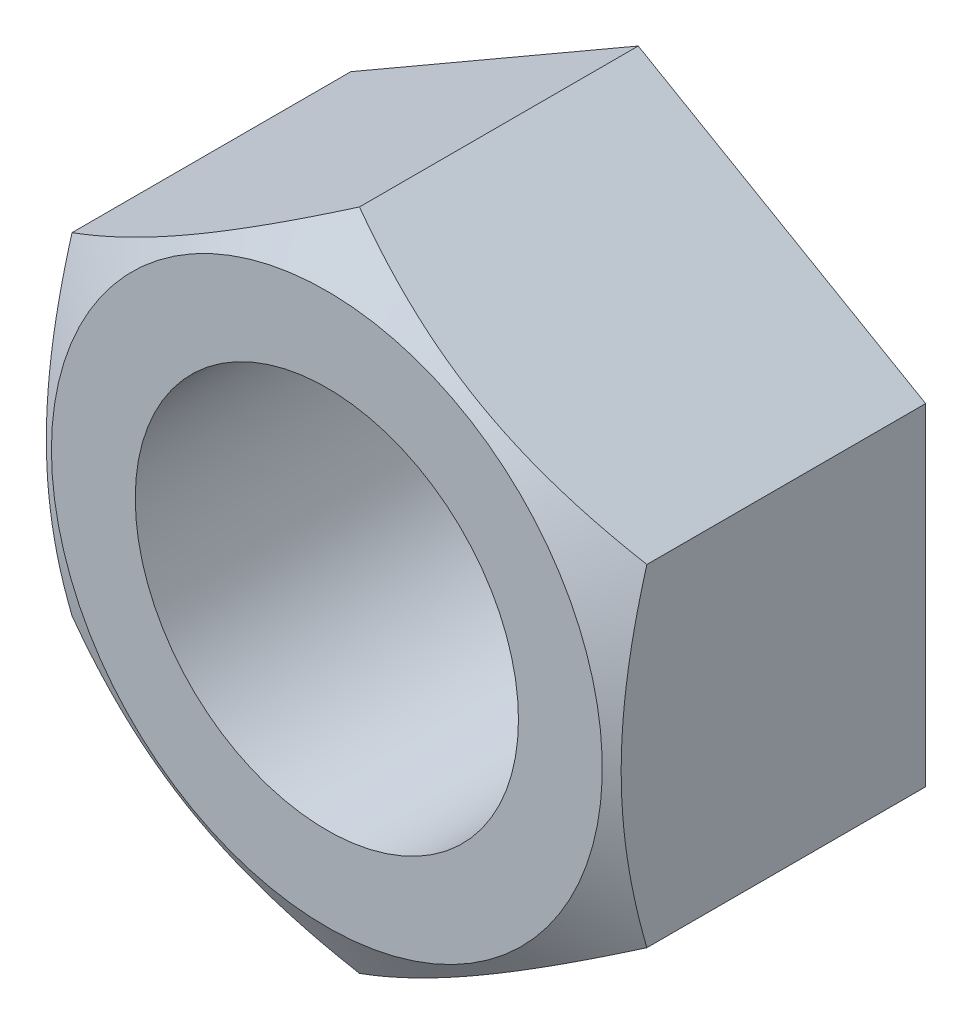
ISO-10303-21;
HEADER;
FILE_DESCRIPTION(('STEP AP214'),'2;1');
FILE_NAME('part.step','',(''),(''),'','','');
FILE_SCHEMA(('AUTOMOTIVE_DESIGN { 1 0 10303 214 1 1 1 1 }'));
ENDSEC;
DATA;
#1=APPLICATION_CONTEXT('core data for automotive mechanical design processes');
#2=APPLICATION_PROTOCOL_DEFINITION('international standard','automotive_design',2000,#1);
#3=PRODUCT_CONTEXT('',#1,'mechanical');
#4=PRODUCT('Part','Part','',(#3));
#5=PRODUCT_RELATED_PRODUCT_CATEGORY('part','',(#4));
#6=PRODUCT_DEFINITION_FORMATION('','',#4);
#7=PRODUCT_DEFINITION_CONTEXT('part definition',#1,'design');
#8=PRODUCT_DEFINITION('design','',#6,#7);
#9=PRODUCT_DEFINITION_SHAPE('','',#8);
#10=(LENGTH_UNIT() NAMED_UNIT(*) SI_UNIT(.MILLI.,.METRE.));
#11=(NAMED_UNIT(*) PLANE_ANGLE_UNIT() SI_UNIT($,.RADIAN.));
#12=(NAMED_UNIT(*) SI_UNIT($,.STERADIAN.) SOLID_ANGLE_UNIT());
#13=UNCERTAINTY_MEASURE_WITH_UNIT(LENGTH_MEASURE(1.E-05),#10,'distance_accuracy_value','');
#14=(GEOMETRIC_REPRESENTATION_CONTEXT(3) GLOBAL_UNCERTAINTY_ASSIGNED_CONTEXT((#13)) GLOBAL_UNIT_ASSIGNED_CONTEXT((#10,
#11,#12)) REPRESENTATION_CONTEXT('',''));
#15=CARTESIAN_POINT('',(0.,0.,0.));
#16=DIRECTION('',(0.,0.,1.));
#17=DIRECTION('',(1.,0.,0.));
#18=AXIS2_PLACEMENT_3D('',#15,#16,#17);
#19=CARTESIAN_POINT('',(-12.,20.7846096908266,13.));
#20=DIRECTION('',(0.,0.,1.));
#21=DIRECTION('',(1.,0.,0.));
#22=AXIS2_PLACEMENT_3D('',#19,#20,#21);
#23=PLANE('',#22);
#24=CARTESIAN_POINT('',(0.,0.,13.));
#25=DIRECTION('',(0.,0.,-1.));
#26=DIRECTION('',(-1.,0.,0.));
#27=AXIS2_PLACEMENT_3D('',#24,#25,#26);
#28=CIRCLE('',#27,11.5);
#29=CARTESIAN_POINT('',(-11.5,0.,13.));
#30=VERTEX_POINT('',#29);
#31=EDGE_CURVE('E171',#30,#30,#28,.T.);
#32=ORIENTED_EDGE('',*,*,#31,.F.);
#33=EDGE_LOOP('',(#32));
#34=FACE_BOUND('',#33,.T.);
#35=CARTESIAN_POINT('',(0.,0.,13.));
#36=DIRECTION('',(0.,0.,1.));
#37=DIRECTION('',(1.,0.,0.));
#38=AXIS2_PLACEMENT_3D('',#35,#36,#37);
#39=CIRCLE('',#38,8.);
#40=CARTESIAN_POINT('',(8.,0.,13.));
#41=VERTEX_POINT('',#40);
#42=EDGE_CURVE('E112',#41,#41,#39,.T.);
#43=ORIENTED_EDGE('',*,*,#42,.F.);
#44=EDGE_LOOP('',(#43));
#45=FACE_BOUND('',#44,.T.);
#46=ADVANCED_FACE('F14',(#34,#45),#23,.T.);
#47=CARTESIAN_POINT('',(-12.,20.7846096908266,0.));
#48=DIRECTION('',(0.,0.,1.));
#49=DIRECTION('',(1.,0.,0.));
#50=AXIS2_PLACEMENT_3D('',#47,#48,#49);
#51=PLANE('',#50);
#52=DIRECTION('',(-0.866025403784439,0.5,0.));
#53=VECTOR('',#52,1.);
#54=CARTESIAN_POINT('',(12.,6.92820323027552,0.));
#55=LINE('',#54,#53);
#56=CARTESIAN_POINT('',(12.,6.92820323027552,0.));
#57=VERTEX_POINT('',#56);
#58=CARTESIAN_POINT('',(0.,13.856406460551,0.));
#59=VERTEX_POINT('',#58);
#60=EDGE_CURVE('E107',#57,#59,#55,.T.);
#61=ORIENTED_EDGE('',*,*,#60,.F.);
#62=DIRECTION('',(0.,1.,0.));
#63=VECTOR('',#62,1.);
#64=CARTESIAN_POINT('',(12.,-6.92820323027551,0.));
#65=LINE('',#64,#63);
#66=CARTESIAN_POINT('',(12.,-6.92820323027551,0.));
#67=VERTEX_POINT('',#66);
#68=EDGE_CURVE('E83',#67,#57,#65,.T.);
#69=ORIENTED_EDGE('',*,*,#68,.F.);
#70=DIRECTION('',(0.866025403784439,0.5,0.));
#71=VECTOR('',#70,1.);
#72=CARTESIAN_POINT('',(0.,-13.856406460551,0.));
#73=LINE('',#72,#71);
#74=CARTESIAN_POINT('',(0.,-13.856406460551,0.));
#75=VERTEX_POINT('',#74);
#76=EDGE_CURVE('E89',#75,#67,#73,.T.);
#77=ORIENTED_EDGE('',*,*,#76,.F.);
#78=DIRECTION('',(0.866025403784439,-0.5,0.));
#79=VECTOR('',#78,1.);
#80=CARTESIAN_POINT('',(-12.,-6.92820323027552,0.));
#81=LINE('',#80,#79);
#82=CARTESIAN_POINT('',(-12.,-6.92820323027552,0.));
#83=VERTEX_POINT('',#82);
#84=EDGE_CURVE('E119',#83,#75,#81,.T.);
#85=ORIENTED_EDGE('',*,*,#84,.F.);
#86=DIRECTION('',(0.,-1.,0.));
#87=VECTOR('',#86,1.);
#88=CARTESIAN_POINT('',(-12.,6.92820323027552,0.));
#89=LINE('',#88,#87);
#90=CARTESIAN_POINT('',(-12.,6.92820323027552,0.));
#91=VERTEX_POINT('',#90);
#92=EDGE_CURVE('E110',#91,#83,#89,.T.);
#93=ORIENTED_EDGE('',*,*,#92,.F.);
#94=DIRECTION('',(-0.866025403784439,-0.5,0.));
#95=VECTOR('',#94,1.);
#96=CARTESIAN_POINT('',(0.,13.856406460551,0.));
#97=LINE('',#96,#95);
#98=EDGE_CURVE('E102',#59,#91,#97,.T.);
#99=ORIENTED_EDGE('',*,*,#98,.F.);
#100=EDGE_LOOP('',(#61,#69,#77,#85,#93,#99));
#101=FACE_BOUND('',#100,.T.);
#102=CARTESIAN_POINT('',(0.,0.,0.));
#103=DIRECTION('',(0.,0.,1.));
#104=DIRECTION('',(1.,0.,0.));
#105=AXIS2_PLACEMENT_3D('',#102,#103,#104);
#106=CIRCLE('',#105,8.);
#107=CARTESIAN_POINT('',(8.,0.,0.));
#108=VERTEX_POINT('',#107);
#109=EDGE_CURVE('E78',#108,#108,#106,.T.);
#110=ORIENTED_EDGE('',*,*,#109,.T.);
#111=EDGE_LOOP('',(#110));
#112=FACE_BOUND('',#111,.T.);
#113=ADVANCED_FACE('F105',(#101,#112),#51,.F.);
#114=CARTESIAN_POINT('',(12.,6.92820323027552,13.));
#115=DIRECTION('',(-0.5,-0.866025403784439,0.));
#116=DIRECTION('',(0.866025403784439,-0.5,0.));
#117=AXIS2_PLACEMENT_3D('',#114,#115,#116);
#118=PLANE('',#117);
#119=DIRECTION('',(0.,0.,-1.));
#120=VECTOR('',#119,1.);
#121=CARTESIAN_POINT('',(0.,13.856406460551,13.));
#122=LINE('',#121,#120);
#123=CARTESIAN_POINT('',(0.,13.856406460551,11.6395280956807));
#124=VERTEX_POINT('',#123);
#125=EDGE_CURVE('E29',#124,#59,#122,.T.);
#126=ORIENTED_EDGE('',*,*,#125,.F.);
#127=CARTESIAN_POINT('',(-0.0002,13.8565219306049,11.6394614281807));
#128=CARTESIAN_POINT('',(0.263585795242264,13.7042251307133,11.7273752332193));
#129=CARTESIAN_POINT('',(0.528355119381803,13.5513604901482,11.8112988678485));
#130=CARTESIAN_POINT('',(1.06001701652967,13.244405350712,11.9700586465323));
#131=CARTESIAN_POINT('',(1.32691025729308,13.0903144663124,12.0448918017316));
#132=CARTESIAN_POINT('',(2.13189040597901,12.6255589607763,12.254307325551));
#133=CARTESIAN_POINT('',(2.67315507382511,12.3130596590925,12.3734216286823));
#134=CARTESIAN_POINT('',(3.48313282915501,11.8454187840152,12.513093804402));
#135=CARTESIAN_POINT('',(3.74942610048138,11.6916742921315,12.5528810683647));
#136=CARTESIAN_POINT('',(4.28324559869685,11.3834734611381,12.6196014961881));
#137=CARTESIAN_POINT('',(4.55077184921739,11.2290171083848,12.6465344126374));
#138=CARTESIAN_POINT('',(5.08627036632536,10.9198468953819,12.6868562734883));
#139=CARTESIAN_POINT('',(5.35424172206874,10.7651335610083,12.7002613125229));
#140=CARTESIAN_POINT('',(5.89043273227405,10.4555635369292,12.713241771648));
#141=CARTESIAN_POINT('',(6.15865237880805,10.3007068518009,12.7128176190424));
#142=CARTESIAN_POINT('',(6.66008937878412,10.011202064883,12.6991048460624));
#143=CARTESIAN_POINT('',(6.89334249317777,9.87653331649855,12.6874888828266));
#144=CARTESIAN_POINT('',(7.35931224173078,9.60750555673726,12.6540168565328));
#145=CARTESIAN_POINT('',(7.59202883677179,9.47314656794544,12.632160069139));
#146=CARTESIAN_POINT('',(8.05679907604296,9.2048113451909,12.5785874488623));
#147=CARTESIAN_POINT('',(8.28885201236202,9.07083551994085,12.5468634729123));
#148=CARTESIAN_POINT('',(8.75186996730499,8.80351197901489,12.4741130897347));
#149=CARTESIAN_POINT('',(8.98283491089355,8.67016430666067,12.433086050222));
#150=CARTESIAN_POINT('',(9.68394195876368,8.26537996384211,12.2950132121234));
#151=CARTESIAN_POINT('',(10.1520537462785,7.99511549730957,12.1841999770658));
#152=CARTESIAN_POINT('',(11.0812971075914,7.4586165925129,11.9326990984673));
#153=CARTESIAN_POINT('',(11.5424405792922,7.19237528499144,11.7920705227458));
#154=CARTESIAN_POINT('',(12.0002,6.92808776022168,11.6394614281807));
#155=B_SPLINE_CURVE_WITH_KNOTS('',3,(#127,#128,#129,#130,#131,#132,#133,#134,#135,#136,#137,
#138,#139,#140,#141,#142,#143,#144,#145,#146,#147,#148,#149,#150,#151,#152,#153,#154),
.UNSPECIFIED.,.F.,.F.,(4,2,2,2,2,2,2,2,2,2,2,2,2,4),(0.,0.951004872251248,1.90232158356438,
3.80900466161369,4.73894551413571,5.6689042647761,6.59775529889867,7.52657763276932,
8.3351464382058,9.1437724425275,9.95306755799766,10.7624176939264,12.4167102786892,
14.0677556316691),.UNSPECIFIED.);
#156=CARTESIAN_POINT('',(12.,6.92820323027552,11.6395280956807));
#157=VERTEX_POINT('',#156);
#158=EDGE_CURVE('E73',#124,#157,#155,.T.);
#159=ORIENTED_EDGE('',*,*,#158,.T.);
#160=DIRECTION('',(0.,0.,-1.));
#161=VECTOR('',#160,1.);
#162=CARTESIAN_POINT('',(12.,6.92820323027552,13.));
#163=LINE('',#162,#161);
#164=EDGE_CURVE('E43',#157,#57,#163,.T.);
#165=ORIENTED_EDGE('',*,*,#164,.T.);
#166=ORIENTED_EDGE('',*,*,#60,.T.);
#167=EDGE_LOOP('',(#126,#159,#165,#166));
#168=FACE_BOUND('',#167,.T.);
#169=ADVANCED_FACE('F16',(#168),#118,.F.);
#170=CARTESIAN_POINT('',(0.,13.856406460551,13.));
#171=DIRECTION('',(0.5,-0.866025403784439,0.));
#172=DIRECTION('',(0.866025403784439,0.5,0.));
#173=AXIS2_PLACEMENT_3D('',#170,#171,#172);
#174=PLANE('',#173);
#175=DIRECTION('',(0.,0.,-1.));
#176=VECTOR('',#175,1.);
#177=CARTESIAN_POINT('',(-12.,6.92820323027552,13.));
#178=LINE('',#177,#176);
#179=CARTESIAN_POINT('',(-12.,6.92820323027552,11.6395280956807));
#180=VERTEX_POINT('',#179);
#181=EDGE_CURVE('E96',#180,#91,#178,.T.);
#182=ORIENTED_EDGE('',*,*,#181,.F.);
#183=CARTESIAN_POINT('',(-12.0002,6.92808776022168,11.6394614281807));
#184=CARTESIAN_POINT('',(-11.7364142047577,7.0803845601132,11.7273752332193));
#185=CARTESIAN_POINT('',(-11.4716448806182,7.23324920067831,11.8112988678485));
#186=CARTESIAN_POINT('',(-10.9399829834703,7.5402043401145,11.9700586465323));
#187=CARTESIAN_POINT('',(-10.6730897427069,7.69429522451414,12.0448918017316));
#188=CARTESIAN_POINT('',(-9.86810959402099,8.15905073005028,12.254307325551));
#189=CARTESIAN_POINT('',(-9.3268449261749,8.47155003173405,12.3734216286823));
#190=CARTESIAN_POINT('',(-8.516867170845,8.93919090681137,12.513093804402));
#191=CARTESIAN_POINT('',(-8.25057389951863,9.09293539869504,12.5528810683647));
#192=CARTESIAN_POINT('',(-7.71675440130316,9.40113622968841,12.6196014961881));
#193=CARTESIAN_POINT('',(-7.44922815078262,9.55559258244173,12.6465344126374));
#194=CARTESIAN_POINT('',(-6.91372963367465,9.86476279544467,12.6868562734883));
#195=CARTESIAN_POINT('',(-6.64575827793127,10.0194761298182,12.7002613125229));
#196=CARTESIAN_POINT('',(-6.10956726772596,10.3290461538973,12.713241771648));
#197=CARTESIAN_POINT('',(-5.84134762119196,10.4839028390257,12.7128176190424));
#198=CARTESIAN_POINT('',(-5.33991062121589,10.7734076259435,12.6991048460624));
#199=CARTESIAN_POINT('',(-5.10665750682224,10.908076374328,12.6874888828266));
#200=CARTESIAN_POINT('',(-4.64068775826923,11.1771041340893,12.6540168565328));
#201=CARTESIAN_POINT('',(-4.40797116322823,11.3114631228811,12.632160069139));
#202=CARTESIAN_POINT('',(-3.94320092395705,11.5797983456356,12.5785874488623));
#203=CARTESIAN_POINT('',(-3.71114798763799,11.7137741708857,12.5468634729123));
#204=CARTESIAN_POINT('',(-3.24813003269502,11.9810977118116,12.4741130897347));
#205=CARTESIAN_POINT('',(-3.01716508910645,12.1144453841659,12.433086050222));
#206=CARTESIAN_POINT('',(-2.31605804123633,12.5192297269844,12.2950132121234));
#207=CARTESIAN_POINT('',(-1.84794625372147,12.789494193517,12.1841999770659));
#208=CARTESIAN_POINT('',(-0.918702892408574,13.3259930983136,11.9326990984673));
#209=CARTESIAN_POINT('',(-0.457559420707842,13.5922344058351,11.7920705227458));
#210=CARTESIAN_POINT('',(0.000200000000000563,13.8565219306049,11.6394614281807));
#211=B_SPLINE_CURVE_WITH_KNOTS('',3,(#183,#184,#185,#186,#187,#188,#189,#190,#191,#192,#193,
#194,#195,#196,#197,#198,#199,#200,#201,#202,#203,#204,#205,#206,#207,#208,#209,#210),
.UNSPECIFIED.,.F.,.F.,(4,2,2,2,2,2,2,2,2,2,2,2,2,4),(0.,0.951004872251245,1.90232158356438,
3.80900466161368,4.7389455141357,5.66890426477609,6.59775529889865,7.5265776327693,
8.33514643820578,9.14377244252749,9.95306755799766,10.7624176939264,12.4167102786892,
14.0677556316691),.UNSPECIFIED.);
#212=EDGE_CURVE('E79',#180,#124,#211,.T.);
#213=ORIENTED_EDGE('',*,*,#212,.T.);
#214=ORIENTED_EDGE('',*,*,#125,.T.);
#215=ORIENTED_EDGE('',*,*,#98,.T.);
#216=EDGE_LOOP('',(#182,#213,#214,#215));
#217=FACE_BOUND('',#216,.T.);
#218=ADVANCED_FACE('F101',(#217),#174,.F.);
#219=CARTESIAN_POINT('',(-12.,6.92820323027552,13.));
#220=DIRECTION('',(1.,0.,0.));
#221=DIRECTION('',(0.,1.,0.));
#222=AXIS2_PLACEMENT_3D('',#219,#220,#221);
#223=PLANE('',#222);
#224=DIRECTION('',(0.,0.,-1.));
#225=VECTOR('',#224,1.);
#226=CARTESIAN_POINT('',(-12.,-6.92820323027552,13.));
#227=LINE('',#226,#225);
#228=CARTESIAN_POINT('',(-12.,-6.92820323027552,11.6395280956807));
#229=VERTEX_POINT('',#228);
#230=EDGE_CURVE('E94',#229,#83,#227,.T.);
#231=ORIENTED_EDGE('',*,*,#230,.F.);
#232=CARTESIAN_POINT('',(-12.,-18.4964065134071,6.91007335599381));
#233=CARTESIAN_POINT('',(-12.,-18.2348249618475,7.03676695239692));
#234=CARTESIAN_POINT('',(-12.,-17.9729333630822,7.16282009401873));
#235=CARTESIAN_POINT('',(-12.,-17.4484653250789,7.41350018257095));
#236=CARTESIAN_POINT('',(-12.,-17.1858888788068,7.53812711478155));
#237=CARTESIAN_POINT('',(-12.,-16.3969636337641,7.90968425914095));
#238=CARTESIAN_POINT('',(-12.,-15.8694980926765,8.15425236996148));
#239=CARTESIAN_POINT('',(-12.,-14.8080735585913,8.63693006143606));
#240=CARTESIAN_POINT('',(-12.,-14.274094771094,8.8749962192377));
#241=CARTESIAN_POINT('',(-12.,-13.2018506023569,9.34123668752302));
#242=CARTESIAN_POINT('',(-12.,-12.6635854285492,9.56941147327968));
#243=CARTESIAN_POINT('',(-12.,-11.5649927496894,10.0201902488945));
#244=CARTESIAN_POINT('',(-12.,-11.0045014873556,10.2423972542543));
#245=CARTESIAN_POINT('',(-12.,-9.87691575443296,10.6697177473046));
#246=CARTESIAN_POINT('',(-12.,-9.30982054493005,10.8748293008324));
#247=CARTESIAN_POINT('',(-12.,-8.1692421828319,11.2624880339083));
#248=CARTESIAN_POINT('',(-12.,-7.59577502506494,11.445081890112));
#249=CARTESIAN_POINT('',(-12.,-6.44056116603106,11.7817809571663));
#250=CARTESIAN_POINT('',(-12.,-5.85881717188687,11.9358952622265));
#251=CARTESIAN_POINT('',(-12.,-4.98150097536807,12.1396561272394));
#252=CARTESIAN_POINT('',(-12.,-4.68906134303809,12.202876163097));
#253=CARTESIAN_POINT('',(-12.,-4.10220552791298,12.319414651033));
#254=CARTESIAN_POINT('',(-12.,-3.80778938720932,12.372733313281));
#255=CARTESIAN_POINT('',(-12.,-3.21719134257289,12.4685211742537));
#256=CARTESIAN_POINT('',(-12.,-2.9210094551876,12.5109904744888));
#257=CARTESIAN_POINT('',(-12.,-2.32720366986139,12.5842281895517));
#258=CARTESIAN_POINT('',(-12.,-2.02957982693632,12.6149970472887));
#259=CARTESIAN_POINT('',(-12.,-1.43714190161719,12.6638431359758));
#260=CARTESIAN_POINT('',(-12.,-1.1423409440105,12.6820785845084));
#261=CARTESIAN_POINT('',(-12.,-0.552233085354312,12.7060743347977));
#262=CARTESIAN_POINT('',(-12.,-0.256926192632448,12.7118348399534));
#263=CARTESIAN_POINT('',(-12.,0.333668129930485,12.7107440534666));
#264=CARTESIAN_POINT('',(-12.,0.62895555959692,12.7038926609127));
#265=CARTESIAN_POINT('',(-12.,1.21898241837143,12.6777432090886));
#266=CARTESIAN_POINT('',(-12.,1.5137218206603,12.6584445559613));
#267=CARTESIAN_POINT('',(-12.,2.22554423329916,12.5972105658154));
#268=CARTESIAN_POINT('',(-12.,2.64211159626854,12.5491768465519));
#269=CARTESIAN_POINT('',(-12.,3.47208181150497,12.4308891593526));
#270=CARTESIAN_POINT('',(-12.,3.88548421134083,12.3606320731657));
#271=CARTESIAN_POINT('',(-12.,4.7087553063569,12.2003971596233));
#272=CARTESIAN_POINT('',(-12.,5.1186209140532,12.1104036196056));
#273=CARTESIAN_POINT('',(-12.,5.93420536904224,11.9134352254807));
#274=CARTESIAN_POINT('',(-12.,6.33992428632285,11.8064606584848));
#275=CARTESIAN_POINT('',(-12.,7.15607883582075,11.5756142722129));
#276=CARTESIAN_POINT('',(-12.,7.56642387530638,11.451424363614));
#277=CARTESIAN_POINT('',(-12.,8.38307044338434,11.1904609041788));
#278=CARTESIAN_POINT('',(-12.,8.78937194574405,11.0536872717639));
#279=CARTESIAN_POINT('',(-12.,9.5981366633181,10.7697062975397));
#280=CARTESIAN_POINT('',(-12.,10.0006011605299,10.6225025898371));
#281=CARTESIAN_POINT('',(-12.,10.8022117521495,10.319368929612));
#282=CARTESIAN_POINT('',(-12.,11.2013578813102,10.1634390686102));
#283=CARTESIAN_POINT('',(-12.,12.1262127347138,9.79234278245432));
#284=CARTESIAN_POINT('',(-12.,12.6508137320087,9.5744201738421));
#285=CARTESIAN_POINT('',(-12.,13.6957041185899,9.12844425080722));
#286=CARTESIAN_POINT('',(-12.,14.2159932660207,8.90039037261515));
#287=CARTESIAN_POINT('',(-12.,15.2530413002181,8.43613483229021));
#288=CARTESIAN_POINT('',(-12.,15.7697994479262,8.19993152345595));
#289=CARTESIAN_POINT('',(-12.,16.8002554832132,7.72098206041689));
#290=CARTESIAN_POINT('',(-12.,17.3139534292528,7.47823603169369));
#291=CARTESIAN_POINT('',(-12.,18.3393079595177,6.98714753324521));
#292=CARTESIAN_POINT('',(-12.,18.8509619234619,6.73879960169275));
#293=CARTESIAN_POINT('',(-12.,19.8721014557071,6.23768613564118));
#294=CARTESIAN_POINT('',(-12.,20.3815870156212,5.98492058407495));
#295=CARTESIAN_POINT('',(-12.,21.3986564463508,5.47574394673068));
#296=CARTESIAN_POINT('',(-12.,21.9062405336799,5.21933329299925));
#297=CARTESIAN_POINT('',(-12.,22.9198367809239,4.70342199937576));
#298=CARTESIAN_POINT('',(-12.,23.4258489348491,4.44392134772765));
#299=CARTESIAN_POINT('',(-12.,24.85998839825,3.70377050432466));
#300=CARTESIAN_POINT('',(-12.,25.786517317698,3.22002319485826));
#301=CARTESIAN_POINT('',(-12.,27.6361269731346,2.24592447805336));
#302=CARTESIAN_POINT('',(-12.,28.5592075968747,1.7555728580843));
#303=CARTESIAN_POINT('',(-12.,30.4004956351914,0.770947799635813));
#304=CARTESIAN_POINT('',(-12.,31.3187093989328,0.276686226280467));
#305=CARTESIAN_POINT('',(-12.,32.6943950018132,-0.467667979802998));
#306=CARTESIAN_POINT('',(-12.,33.1526727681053,-0.71627335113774));
#307=CARTESIAN_POINT('',(-12.,34.0687438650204,-1.2143734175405));
#308=CARTESIAN_POINT('',(-12.,34.5265371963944,-1.46386811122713));
#309=CARTESIAN_POINT('',(-12.,34.9841154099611,-1.71375682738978));
#310=B_SPLINE_CURVE_WITH_KNOTS('',3,(#232,#233,#234,#235,#236,#237,#238,#239,#240,#241,#242,
#243,#244,#245,#246,#247,#248,#249,#250,#251,#252,#253,#254,#255,#256,#257,#258,#259,#260,#261,
#262,#263,#264,#265,#266,#267,#268,#269,#270,#271,#272,#273,#274,#275,#276,#277,#278,#279,#280,
#281,#282,#283,#284,#285,#286,#287,#288,#289,#290,#291,#292,#293,#294,#295,#296,#297,#298,#299,
#300,#301,#302,#303,#304,#305,#306,#307,#308,#309),.UNSPECIFIED.,.F.,.F.,(4,2,2,2,2,2,2,2,2,2,2,
2,2,2,2,2,2,2,2,2,2,2,2,2,2,2,2,2,2,2,2,2,2,2,2,2,2,2,4),(0.,0.871941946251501,1.74389288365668,
3.48805876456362,5.24191326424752,6.99568339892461,8.80426505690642,10.6130510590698,
12.4180222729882,14.2224161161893,15.1198609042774,16.0172866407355,16.9147039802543,
17.8120873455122,18.6979234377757,19.5837450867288,20.4695738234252,21.355444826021,
22.6127292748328,23.8701902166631,25.1286559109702,26.3871003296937,27.6730372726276,
28.9589825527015,30.2444819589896,31.5299678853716,33.234016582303,34.9381602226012,
36.6426502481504,38.34710760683,40.0533055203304,41.7595100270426,43.46551395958,
45.1715243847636,48.30711904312,51.4428148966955,54.5711716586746,56.1352707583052,
57.6993674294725),.UNSPECIFIED.);
#311=EDGE_CURVE('E134',#229,#180,#310,.T.);
#312=ORIENTED_EDGE('',*,*,#311,.T.);
#313=ORIENTED_EDGE('',*,*,#181,.T.);
#314=ORIENTED_EDGE('',*,*,#92,.T.);
#315=EDGE_LOOP('',(#231,#312,#313,#314));
#316=FACE_BOUND('',#315,.T.);
#317=ADVANCED_FACE('F133',(#316),#223,.F.);
#318=CARTESIAN_POINT('',(-12.,-6.92820323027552,13.));
#319=DIRECTION('',(0.5,0.866025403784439,0.));
#320=DIRECTION('',(-0.866025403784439,0.5,0.));
#321=AXIS2_PLACEMENT_3D('',#318,#319,#320);
#322=PLANE('',#321);
#323=DIRECTION('',(0.,0.,-1.));
#324=VECTOR('',#323,1.);
#325=CARTESIAN_POINT('',(0.,-13.856406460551,13.));
#326=LINE('',#325,#324);
#327=CARTESIAN_POINT('',(0.,-13.856406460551,11.6395280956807));
#328=VERTEX_POINT('',#327);
#329=EDGE_CURVE('E87',#328,#75,#326,.T.);
#330=ORIENTED_EDGE('',*,*,#329,.F.);
#331=CARTESIAN_POINT('',(0.000199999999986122,-13.8565219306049,11.6394614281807));
#332=CARTESIAN_POINT('',(-0.26358579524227,-13.7042251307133,11.7273752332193));
#333=CARTESIAN_POINT('',(-0.528355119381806,-13.5513604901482,11.8112988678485));
#334=CARTESIAN_POINT('',(-1.06001701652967,-13.244405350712,11.9700586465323));
#335=CARTESIAN_POINT('',(-1.32691025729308,-13.0903144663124,12.0448918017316));
#336=CARTESIAN_POINT('',(-2.13189040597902,-12.6255589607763,12.254307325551));
#337=CARTESIAN_POINT('',(-2.67315507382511,-12.3130596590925,12.3734216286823));
#338=CARTESIAN_POINT('',(-3.48313282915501,-11.8454187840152,12.513093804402));
#339=CARTESIAN_POINT('',(-3.74942610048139,-11.6916742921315,12.5528810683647));
#340=CARTESIAN_POINT('',(-4.28324559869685,-11.3834734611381,12.6196014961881));
#341=CARTESIAN_POINT('',(-4.5507718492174,-11.2290171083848,12.6465344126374));
#342=CARTESIAN_POINT('',(-5.08627036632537,-10.9198468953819,12.6868562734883));
#343=CARTESIAN_POINT('',(-5.35424172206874,-10.7651335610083,12.7002613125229));
#344=CARTESIAN_POINT('',(-5.89043273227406,-10.4555635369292,12.713241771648));
#345=CARTESIAN_POINT('',(-6.15865237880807,-10.3007068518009,12.7128176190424));
#346=CARTESIAN_POINT('',(-6.66008937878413,-10.0112020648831,12.6991048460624));
#347=CARTESIAN_POINT('',(-6.89334249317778,-9.87653331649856,12.6874888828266));
#348=CARTESIAN_POINT('',(-7.35931224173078,-9.60750555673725,12.6540168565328));
#349=CARTESIAN_POINT('',(-7.59202883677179,-9.47314656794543,12.632160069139));
#350=CARTESIAN_POINT('',(-8.05679907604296,-9.2048113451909,12.5785874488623));
#351=CARTESIAN_POINT('',(-8.28885201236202,-9.07083551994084,12.5468634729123));
#352=CARTESIAN_POINT('',(-8.751869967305,-8.80351197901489,12.4741130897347));
#353=CARTESIAN_POINT('',(-8.98283491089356,-8.67016430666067,12.433086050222));
#354=CARTESIAN_POINT('',(-9.68394195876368,-8.26537996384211,12.2950132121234));
#355=CARTESIAN_POINT('',(-10.1520537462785,-7.99511549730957,12.1841999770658));
#356=CARTESIAN_POINT('',(-11.0812971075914,-7.4586165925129,11.9326990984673));
#357=CARTESIAN_POINT('',(-11.5424405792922,-7.19237528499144,11.7920705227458));
#358=CARTESIAN_POINT('',(-12.0002,-6.92808776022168,11.6394614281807));
#359=B_SPLINE_CURVE_WITH_KNOTS('',3,(#331,#332,#333,#334,#335,#336,#337,#338,#339,#340,#341,
#342,#343,#344,#345,#346,#347,#348,#349,#350,#351,#352,#353,#354,#355,#356,#357,#358),
.UNSPECIFIED.,.F.,.F.,(4,2,2,2,2,2,2,2,2,2,2,2,2,4),(0.,0.951004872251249,1.90232158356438,
3.8090046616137,4.73894551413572,5.66890426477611,6.59775529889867,7.52657763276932,
8.3351464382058,9.14377244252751,9.95306755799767,10.7624176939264,12.4167102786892,
14.0677556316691),.UNSPECIFIED.);
#360=EDGE_CURVE('E130',#328,#229,#359,.T.);
#361=ORIENTED_EDGE('',*,*,#360,.T.);
#362=ORIENTED_EDGE('',*,*,#230,.T.);
#363=ORIENTED_EDGE('',*,*,#84,.T.);
#364=EDGE_LOOP('',(#330,#361,#362,#363));
#365=FACE_BOUND('',#364,.T.);
#366=ADVANCED_FACE('F127',(#365),#322,.F.);
#367=CARTESIAN_POINT('',(0.,-13.856406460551,13.));
#368=DIRECTION('',(-0.5,0.866025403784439,0.));
#369=DIRECTION('',(-0.866025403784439,-0.5,0.));
#370=AXIS2_PLACEMENT_3D('',#367,#368,#369);
#371=PLANE('',#370);
#372=DIRECTION('',(0.,0.,-1.));
#373=VECTOR('',#372,1.);
#374=CARTESIAN_POINT('',(12.,-6.92820323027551,13.));
#375=LINE('',#374,#373);
#376=CARTESIAN_POINT('',(12.,-6.92820323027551,11.6395280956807));
#377=VERTEX_POINT('',#376);
#378=EDGE_CURVE('E85',#377,#67,#375,.T.);
#379=ORIENTED_EDGE('',*,*,#378,.F.);
#380=CARTESIAN_POINT('',(12.0002,-6.92808776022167,11.6394614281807));
#381=CARTESIAN_POINT('',(11.7364142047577,-7.0803845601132,11.7273752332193));
#382=CARTESIAN_POINT('',(11.4716448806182,-7.23324920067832,11.8112988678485));
#383=CARTESIAN_POINT('',(10.9399829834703,-7.54020434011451,11.9700586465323));
#384=CARTESIAN_POINT('',(10.6730897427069,-7.69429522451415,12.0448918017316));
#385=CARTESIAN_POINT('',(9.868109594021,-8.15905073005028,12.254307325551));
#386=CARTESIAN_POINT('',(9.32684492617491,-8.47155003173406,12.3734216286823));
#387=CARTESIAN_POINT('',(8.51686717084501,-8.93919090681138,12.513093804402));
#388=CARTESIAN_POINT('',(8.25057389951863,-9.09293539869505,12.5528810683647));
#389=CARTESIAN_POINT('',(7.71675440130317,-9.40113622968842,12.6196014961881));
#390=CARTESIAN_POINT('',(7.44922815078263,-9.55559258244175,12.6465344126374));
#391=CARTESIAN_POINT('',(6.91372963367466,-9.86476279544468,12.6868562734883));
#392=CARTESIAN_POINT('',(6.64575827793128,-10.0194761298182,12.7002613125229));
#393=CARTESIAN_POINT('',(6.10956726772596,-10.3290461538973,12.713241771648));
#394=CARTESIAN_POINT('',(5.84134762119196,-10.4839028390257,12.7128176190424));
#395=CARTESIAN_POINT('',(5.33991062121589,-10.7734076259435,12.6991048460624));
#396=CARTESIAN_POINT('',(5.10665750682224,-10.908076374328,12.6874888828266));
#397=CARTESIAN_POINT('',(4.64068775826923,-11.1771041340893,12.6540168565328));
#398=CARTESIAN_POINT('',(4.40797116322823,-11.3114631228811,12.632160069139));
#399=CARTESIAN_POINT('',(3.94320092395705,-11.5797983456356,12.5785874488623));
#400=CARTESIAN_POINT('',(3.71114798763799,-11.7137741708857,12.5468634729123));
#401=CARTESIAN_POINT('',(3.24813003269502,-11.9810977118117,12.4741130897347));
#402=CARTESIAN_POINT('',(3.01716508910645,-12.1144453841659,12.433086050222));
#403=CARTESIAN_POINT('',(2.31605804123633,-12.5192297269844,12.2950132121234));
#404=CARTESIAN_POINT('',(1.84794625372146,-12.789494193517,12.1841999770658));
#405=CARTESIAN_POINT('',(0.918702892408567,-13.3259930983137,11.9326990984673));
#406=CARTESIAN_POINT('',(0.457559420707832,-13.5922344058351,11.7920705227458));
#407=CARTESIAN_POINT('',(-0.00020000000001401,-13.8565219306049,11.6394614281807));
#408=B_SPLINE_CURVE_WITH_KNOTS('',3,(#380,#381,#382,#383,#384,#385,#386,#387,#388,#389,#390,
#391,#392,#393,#394,#395,#396,#397,#398,#399,#400,#401,#402,#403,#404,#405,#406,#407),
.UNSPECIFIED.,.F.,.F.,(4,2,2,2,2,2,2,2,2,2,2,2,2,4),(0.,0.951004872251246,1.90232158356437,
3.80900466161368,4.7389455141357,5.66890426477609,6.59775529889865,7.5265776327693,
8.33514643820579,9.1437724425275,9.95306755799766,10.7624176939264,12.4167102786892,
14.0677556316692),.UNSPECIFIED.);
#409=EDGE_CURVE('E36',#377,#328,#408,.T.);
#410=ORIENTED_EDGE('',*,*,#409,.T.);
#411=ORIENTED_EDGE('',*,*,#329,.T.);
#412=ORIENTED_EDGE('',*,*,#76,.T.);
#413=EDGE_LOOP('',(#379,#410,#411,#412));
#414=FACE_BOUND('',#413,.T.);
#415=ADVANCED_FACE('F124',(#414),#371,.F.);
#416=CARTESIAN_POINT('',(12.,-6.92820323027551,13.));
#417=DIRECTION('',(-1.,0.,0.));
#418=DIRECTION('',(0.,0.,1.));
#419=AXIS2_PLACEMENT_3D('',#416,#417,#418);
#420=PLANE('',#419);
#421=ORIENTED_EDGE('',*,*,#164,.F.);
#422=CARTESIAN_POINT('',(12.,-18.4964065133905,6.91007335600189));
#423=CARTESIAN_POINT('',(12.,-18.2348249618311,7.03676695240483));
#424=CARTESIAN_POINT('',(12.,-17.9729333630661,7.16282009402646));
#425=CARTESIAN_POINT('',(12.,-17.4484653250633,7.41350018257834));
#426=CARTESIAN_POINT('',(12.,-17.1858888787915,7.53812711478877));
#427=CARTESIAN_POINT('',(12.,-16.3969636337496,7.90968425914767));
#428=CARTESIAN_POINT('',(12.,-15.8694980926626,8.15425236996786));
#429=CARTESIAN_POINT('',(12.,-14.8080735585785,8.63693006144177));
#430=CARTESIAN_POINT('',(12.,-14.2740947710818,8.87499621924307));
#431=CARTESIAN_POINT('',(12.,-13.2018506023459,9.34123668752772));
#432=CARTESIAN_POINT('',(12.,-12.6635854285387,9.56941147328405));
#433=CARTESIAN_POINT('',(12.,-11.5649927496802,10.0201902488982));
#434=CARTESIAN_POINT('',(12.,-11.0045014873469,10.2423972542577));
#435=CARTESIAN_POINT('',(12.,-9.87691575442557,10.6697177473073));
#436=CARTESIAN_POINT('',(12.,-9.30982054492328,10.8748293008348));
#437=CARTESIAN_POINT('',(12.,-8.1692421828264,11.2624880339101));
#438=CARTESIAN_POINT('',(12.,-7.59577502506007,11.4450818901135));
#439=CARTESIAN_POINT('',(12.,-6.44056116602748,11.7817809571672));
#440=CARTESIAN_POINT('',(12.,-5.85881717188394,11.9358952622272));
#441=CARTESIAN_POINT('',(12.,-4.9815009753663,12.1396561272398));
#442=CARTESIAN_POINT('',(12.,-4.68906134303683,12.2028761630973));
#443=CARTESIAN_POINT('',(12.,-4.10220552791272,12.319414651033));
#444=CARTESIAN_POINT('',(12.,-3.80778938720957,12.372733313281));
#445=CARTESIAN_POINT('',(12.,-3.21719134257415,12.4685211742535));
#446=CARTESIAN_POINT('',(12.,-2.92100945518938,12.5109904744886));
#447=CARTESIAN_POINT('',(12.,-2.32720366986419,12.5842281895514));
#448=CARTESIAN_POINT('',(12.,-2.02957982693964,12.6149970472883));
#449=CARTESIAN_POINT('',(12.,-1.43714190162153,12.6638431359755));
#450=CARTESIAN_POINT('',(12.,-1.14234094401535,12.6820785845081));
#451=CARTESIAN_POINT('',(12.,-0.552233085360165,12.7060743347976));
#452=CARTESIAN_POINT('',(12.,-0.256926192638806,12.7118348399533));
#453=CARTESIAN_POINT('',(12.,0.333668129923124,12.7107440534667));
#454=CARTESIAN_POINT('',(12.,0.62895555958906,12.7038926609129));
#455=CARTESIAN_POINT('',(12.,1.21898241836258,12.6777432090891));
#456=CARTESIAN_POINT('',(12.,1.51372182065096,12.6584445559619));
#457=CARTESIAN_POINT('',(12.,2.22554423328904,12.5972105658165));
#458=CARTESIAN_POINT('',(12.,2.64211159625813,12.5491768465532));
#459=CARTESIAN_POINT('',(12.,3.47208181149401,12.4308891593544));
#460=CARTESIAN_POINT('',(12.,3.88548421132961,12.3606320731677));
#461=CARTESIAN_POINT('',(12.,4.70875530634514,12.2003971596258));
#462=CARTESIAN_POINT('',(12.,5.11862091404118,12.1104036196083));
#463=CARTESIAN_POINT('',(12.,5.9342053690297,11.9134352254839));
#464=CARTESIAN_POINT('',(12.,6.33992428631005,11.8064606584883));
#465=CARTESIAN_POINT('',(12.,7.15607883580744,11.5756142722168));
#466=CARTESIAN_POINT('',(12.,7.56642387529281,11.4514243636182));
#467=CARTESIAN_POINT('',(12.,8.38307044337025,11.1904609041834));
#468=CARTESIAN_POINT('',(12.,8.78937194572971,11.0536872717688));
#469=CARTESIAN_POINT('',(12.,9.59813666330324,10.7697062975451));
#470=CARTESIAN_POINT('',(12.,10.0006011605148,10.6225025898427));
#471=CARTESIAN_POINT('',(12.,10.8022117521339,10.3193689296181));
#472=CARTESIAN_POINT('',(12.,11.2013578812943,10.1634390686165));
#473=CARTESIAN_POINT('',(12.,12.1262127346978,9.79234278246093));
#474=CARTESIAN_POINT('',(12.,12.6508137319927,9.57442017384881));
#475=CARTESIAN_POINT('',(12.,13.695704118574,9.12844425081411));
#476=CARTESIAN_POINT('',(12.,14.2159932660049,8.90039037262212));
#477=CARTESIAN_POINT('',(12.,15.2530413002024,8.43613483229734));
#478=CARTESIAN_POINT('',(12.,15.7697994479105,8.19993152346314));
#479=CARTESIAN_POINT('',(12.,16.8002554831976,7.72098206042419));
#480=CARTESIAN_POINT('',(12.,17.3139534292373,7.47823603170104));
#481=CARTESIAN_POINT('',(12.,18.3393079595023,6.98714753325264));
#482=CARTESIAN_POINT('',(12.,18.8509619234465,6.73879960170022));
#483=CARTESIAN_POINT('',(12.,19.8721014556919,6.23768613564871));
#484=CARTESIAN_POINT('',(12.,20.3815870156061,5.98492058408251));
#485=CARTESIAN_POINT('',(12.,21.3986564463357,5.47574394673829));
#486=CARTESIAN_POINT('',(12.,21.9062405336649,5.21933329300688));
#487=CARTESIAN_POINT('',(12.,22.919836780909,4.70342199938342));
#488=CARTESIAN_POINT('',(12.,23.4258489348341,4.44392134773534));
#489=CARTESIAN_POINT('',(12.,24.8599883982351,3.70377050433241));
#490=CARTESIAN_POINT('',(12.,25.7865173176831,3.22002319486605));
#491=CARTESIAN_POINT('',(12.,27.6361269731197,2.24592447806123));
#492=CARTESIAN_POINT('',(12.,28.5592075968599,1.75557285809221));
#493=CARTESIAN_POINT('',(12.,30.4004956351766,0.770947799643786));
#494=CARTESIAN_POINT('',(12.,31.3187093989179,0.276686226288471));
#495=CARTESIAN_POINT('',(12.,32.6943950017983,-0.467667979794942));
#496=CARTESIAN_POINT('',(12.,33.1526727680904,-0.716273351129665));
#497=CARTESIAN_POINT('',(12.,34.0687438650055,-1.21437341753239));
#498=CARTESIAN_POINT('',(12.,34.5265371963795,-1.463868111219));
#499=CARTESIAN_POINT('',(12.,34.9841154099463,-1.71375682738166));
#500=B_SPLINE_CURVE_WITH_KNOTS('',3,(#422,#423,#424,#425,#426,#427,#428,#429,#430,#431,#432,
#433,#434,#435,#436,#437,#438,#439,#440,#441,#442,#443,#444,#445,#446,#447,#448,#449,#450,#451,
#452,#453,#454,#455,#456,#457,#458,#459,#460,#461,#462,#463,#464,#465,#466,#467,#468,#469,#470,
#471,#472,#473,#474,#475,#476,#477,#478,#479,#480,#481,#482,#483,#484,#485,#486,#487,#488,#489,
#490,#491,#492,#493,#494,#495,#496,#497,#498,#499),.UNSPECIFIED.,.F.,.F.,(4,2,2,2,2,2,2,2,2,2,2,
2,2,2,2,2,2,2,2,2,2,2,2,2,2,2,2,2,2,2,2,2,2,2,2,2,2,2,4),(0.,0.871941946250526,1.74389288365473,
3.48805876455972,5.24191326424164,6.99568339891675,8.80426505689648,10.6130510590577,
12.418022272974,14.2224161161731,15.1198609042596,16.0172866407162,16.9147039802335,
17.8120873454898,18.6979234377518,19.5837450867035,20.4695738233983,21.3554448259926,
22.6127292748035,23.8701902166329,25.128655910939,26.3871003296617,27.6730372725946,
28.9589825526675,30.2444819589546,31.5299678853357,33.2340165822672,34.9381602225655,
36.6426502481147,38.3471076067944,40.0533055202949,41.7595100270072,43.4655139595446,
45.1715243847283,48.3071190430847,51.4428148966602,54.5711716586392,56.1352707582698,
57.6993674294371),.UNSPECIFIED.);
#501=EDGE_CURVE('E9',#157,#377,#500,.F.);
#502=ORIENTED_EDGE('',*,*,#501,.T.);
#503=ORIENTED_EDGE('',*,*,#378,.T.);
#504=ORIENTED_EDGE('',*,*,#68,.T.);
#505=EDGE_LOOP('',(#421,#502,#503,#504));
#506=FACE_BOUND('',#505,.T.);
#507=ADVANCED_FACE('F81',(#506),#420,.F.);
#508=CARTESIAN_POINT('',(0.,0.,13.));
#509=DIRECTION('',(0.,0.,-1.));
#510=DIRECTION('',(-1.,0.,0.));
#511=AXIS2_PLACEMENT_3D('',#508,#509,#510);
#512=CYLINDRICAL_SURFACE('',#511,8.);
#513=ORIENTED_EDGE('',*,*,#42,.T.);
#514=EDGE_LOOP('',(#513));
#515=FACE_BOUND('',#514,.T.);
#516=ORIENTED_EDGE('',*,*,#109,.F.);
#517=EDGE_LOOP('',(#516));
#518=FACE_BOUND('',#517,.T.);
#519=ADVANCED_FACE('F157',(#515,#518),#512,.F.);
#520=CARTESIAN_POINT('',(0.,0.,13.));
#521=DIRECTION('',(0.,0.,-1.));
#522=DIRECTION('',(-1.,0.,0.));
#523=AXIS2_PLACEMENT_3D('',#520,#521,#522);
#524=CONICAL_SURFACE('',#523,11.5,1.0471975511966);
#525=ORIENTED_EDGE('',*,*,#31,.T.);
#526=EDGE_LOOP('',(#525));
#527=FACE_BOUND('',#526,.T.);
#528=ORIENTED_EDGE('',*,*,#212,.F.);
#529=ORIENTED_EDGE('',*,*,#311,.F.);
#530=ORIENTED_EDGE('',*,*,#360,.F.);
#531=ORIENTED_EDGE('',*,*,#409,.F.);
#532=ORIENTED_EDGE('',*,*,#501,.F.);
#533=ORIENTED_EDGE('',*,*,#158,.F.);
#534=EDGE_LOOP('',(#528,#529,#530,#531,#532,#533));
#535=FACE_BOUND('',#534,.T.);
#536=ADVANCED_FACE('F72',(#527,#535),#524,.T.);
#537=CLOSED_SHELL('',(#46,#113,#169,#218,#317,#366,#415,#507,#519,#536));
#538=MANIFOLD_SOLID_BREP('B1',#537);
#539=ADVANCED_BREP_SHAPE_REPRESENTATION('',(#18,#538),#14);
#540=SHAPE_DEFINITION_REPRESENTATION(#9,#539);
ENDSEC;
END-ISO-10303-21;
